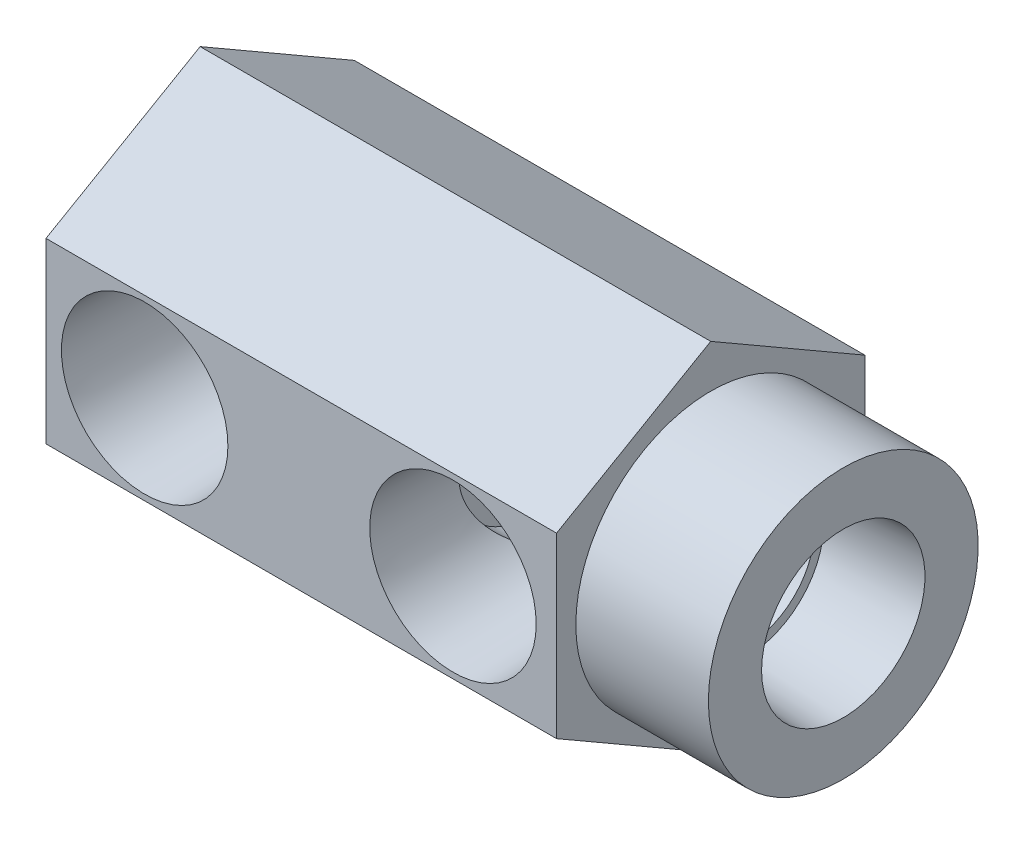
from build123d import *

# Parameters (mm, degrees)
BOSS_EXTRUDE1_DEPTH                 = 42.0624
SKETCH2_R                           = 11.1125
BOSS_EXTRUDE2_DEPTH                 = 52.9844
F_1_4_0_25_DIAMETER_HOLE1_D         = 6.35
F_1_4_0_25_DIAMETER_HOLE1_DEPTH     = 31.75
F_1_4_0_25_DIAMETER_HOLE1_TIP       = 1.907732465
F_7_32_0_21875_DIAMETER_HOLE1_D     = 5.55625
F_7_32_0_21875_DIAMETER_HOLE1_DEPTH = 44.45
F_7_32_0_21875_DIAMETER_HOLE1_TIP   = 1.669265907
F_1_4_NPT_TAPPED_HOLE1_AT_2_COUNT   = 2
F_1_4_NPT_TAPPED_HOLE1_AT_2_PITCH   = 25.4


with BuildPart() as part:
    # Sketch1 → Boss-Extrude1 (new body)
    with BuildSketch(Plane(origin=(0, 0, 0), x_dir=(0, 0, -1), z_dir=(1, 0, 0))):
        Polygon((-12.7, -7.332348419), (0, -14.664696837), (12.7, -7.332348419), (12.7, 7.332348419), (0, 14.664696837), (-12.7, 7.332348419), align=None)
    extrude(amount=BOSS_EXTRUDE1_DEPTH)

    # Sketch2 → Boss-Extrude2 (add)
    with BuildSketch(Plane(origin=(0, 0, 0), x_dir=(0, 0, -1), z_dir=(1, 0, 0))):
        with Locations(Location((0, 0, 0), (0, 0, 180))):
            Circle(SKETCH2_R)
    extrude(amount=BOSS_EXTRUDE2_DEPTH)

    # 1_4 _0.25_ Diameter Hole1
    with Locations(Plane(origin=(52.9844, 0, 0), x_dir=(0, 0, -1), z_dir=(1, 0, 0))):
        with Locations((0, 0)):
            Hole(F_1_4_0_25_DIAMETER_HOLE1_D / 2, depth=F_1_4_0_25_DIAMETER_HOLE1_DEPTH)
            with Locations((0, 0, -(F_1_4_0_25_DIAMETER_HOLE1_DEPTH + F_1_4_0_25_DIAMETER_HOLE1_TIP / 2))):  # 118° drill point
                Cone(0, F_1_4_0_25_DIAMETER_HOLE1_D / 2, F_1_4_0_25_DIAMETER_HOLE1_TIP, mode=Mode.SUBTRACT)

    # 7_32 _0.21875_ Diameter Hole1
    with Locations(Plane(origin=(52.9844, 0, 0), x_dir=(0, 0, -1), z_dir=(1, 0, 0))):
        with Locations((0, 0)):
            Hole(F_7_32_0_21875_DIAMETER_HOLE1_D / 2, depth=F_7_32_0_21875_DIAMETER_HOLE1_DEPTH)
            with Locations((0, 0, -(F_7_32_0_21875_DIAMETER_HOLE1_DEPTH + F_7_32_0_21875_DIAMETER_HOLE1_TIP / 2))):  # 118° drill point
                Cone(0, F_7_32_0_21875_DIAMETER_HOLE1_D / 2, F_7_32_0_21875_DIAMETER_HOLE1_TIP, mode=Mode.SUBTRACT)

    # Sketch7 → 1_4 NPT Tapped Hole1 (revolve, cut)
    with BuildSketch(Plane(origin=(8.128, 0, 12.7), x_dir=(0, -1, 0), z_dir=(1, 0, 0))):
        Polygon((0, 0), (0, 20.411147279), (5.5626, 17.0688), (5.5626, 10.0203), (6.557978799, 10.0203), (6.858, 0), align=None)
    f_1_4_npt_tapped_hole1 = revolve(axis=Axis((8.128, 0, 19.05), (0, 0, -1)), mode=Mode.SUBTRACT)

    # 1_4 NPT Tapped Hole1 at 2: 1_4 NPT Tapped Hole1 ×2
    with Locations(*[(i * F_1_4_NPT_TAPPED_HOLE1_AT_2_PITCH, 0, 0) for i in range(1, F_1_4_NPT_TAPPED_HOLE1_AT_2_COUNT)]):
        add(f_1_4_npt_tapped_hole1, mode=Mode.SUBTRACT)

    # Sketch9 → 1_4 NPT Tapped Hole2 (revolve, cut)
    with BuildSketch(Plane(origin=(8.128, 0, -12.7), x_dir=(0, 1, 0), z_dir=(1, 0, 0))):
        Polygon((0, 0), (0, 20.411147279), (5.5626, 17.0688), (5.5626, 10.0203), (6.557978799, 10.0203), (6.858, 0), align=None)
    revolve(axis=Axis((8.128, 0, -19.05), (0, 0, 1)), mode=Mode.SUBTRACT)

    # Sketch11 → Cut-Revolve1 (revolve, cut)
    with BuildSketch(Plane.XY, mode=Mode.PRIVATE) as cut_revolve1_sk:
        Polygon((52.9844, 6.731), (45.0596, 6.315678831), (45.0596, 5.5499), (26.79065, 5.5499), (26.79065, 0), (52.9844, 0), align=None)
    revolve(cut_revolve1_sk.sketch.rotate(Axis((0, 0, 0), (1, 0, 0)), 90), axis=Axis((0, 0, 0), (1, 0, 0)), mode=Mode.SUBTRACT)


solid = part.part
